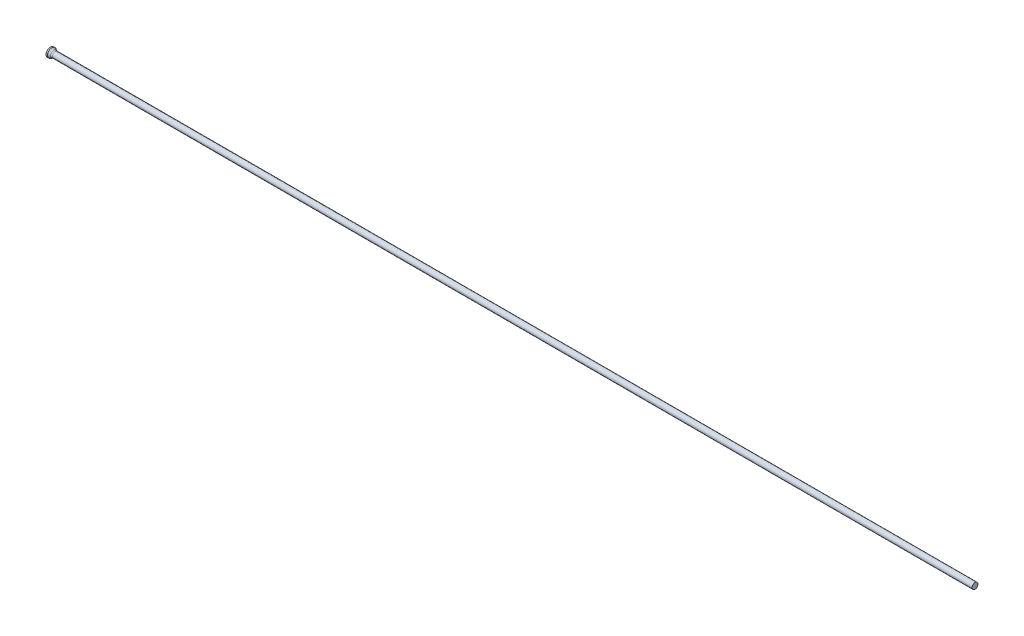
ISO-10303-21;
HEADER;
FILE_DESCRIPTION(('STEP AP214'),'2;1');
FILE_NAME('part.step','',(''),(''),'','','');
FILE_SCHEMA(('AUTOMOTIVE_DESIGN { 1 0 10303 214 1 1 1 1 }'));
ENDSEC;
DATA;
#1=APPLICATION_CONTEXT('core data for automotive mechanical design processes');
#2=APPLICATION_PROTOCOL_DEFINITION('international standard','automotive_design',2000,#1);
#3=PRODUCT_CONTEXT('',#1,'mechanical');
#4=PRODUCT('Part','Part','',(#3));
#5=PRODUCT_RELATED_PRODUCT_CATEGORY('part','',(#4));
#6=PRODUCT_DEFINITION_FORMATION('','',#4);
#7=PRODUCT_DEFINITION_CONTEXT('part definition',#1,'design');
#8=PRODUCT_DEFINITION('design','',#6,#7);
#9=PRODUCT_DEFINITION_SHAPE('','',#8);
#10=(LENGTH_UNIT() NAMED_UNIT(*) SI_UNIT(.MILLI.,.METRE.));
#11=(NAMED_UNIT(*) PLANE_ANGLE_UNIT() SI_UNIT($,.RADIAN.));
#12=(NAMED_UNIT(*) SI_UNIT($,.STERADIAN.) SOLID_ANGLE_UNIT());
#13=UNCERTAINTY_MEASURE_WITH_UNIT(LENGTH_MEASURE(1.E-05),#10,'distance_accuracy_value','');
#14=(GEOMETRIC_REPRESENTATION_CONTEXT(3) GLOBAL_UNCERTAINTY_ASSIGNED_CONTEXT((#13)) GLOBAL_UNIT_ASSIGNED_CONTEXT((#10,
#11,#12)) REPRESENTATION_CONTEXT('',''));
#15=CARTESIAN_POINT('',(0.,0.,0.));
#16=DIRECTION('',(0.,0.,1.));
#17=DIRECTION('',(1.,0.,0.));
#18=AXIS2_PLACEMENT_3D('',#15,#16,#17);
#19=CARTESIAN_POINT('',(0.,0.,0.));
#20=DIRECTION('',(1.,0.,0.));
#21=DIRECTION('',(0.,0.,-1.));
#22=AXIS2_PLACEMENT_3D('',#19,#20,#21);
#23=PLANE('',#22);
#24=CARTESIAN_POINT('',(0.,0.,0.));
#25=DIRECTION('',(-1.,0.,0.));
#26=DIRECTION('',(0.,0.,1.));
#27=AXIS2_PLACEMENT_3D('',#24,#25,#26);
#28=CIRCLE('',#27,1.5);
#29=CARTESIAN_POINT('',(0.,0.,1.5));
#30=VERTEX_POINT('',#29);
#31=EDGE_CURVE('E25',#30,#30,#28,.T.);
#32=ORIENTED_EDGE('',*,*,#31,.T.);
#33=EDGE_LOOP('',(#32));
#34=FACE_BOUND('',#33,.T.);
#35=ADVANCED_FACE('F14',(#34),#23,.F.);
#36=CARTESIAN_POINT('',(0.,0.,0.));
#37=DIRECTION('',(-1.,0.,0.));
#38=DIRECTION('',(0.,0.,1.));
#39=AXIS2_PLACEMENT_3D('',#36,#37,#38);
#40=CYLINDRICAL_SURFACE('',#39,1.5);
#41=ORIENTED_EDGE('',*,*,#31,.F.);
#42=EDGE_LOOP('',(#41));
#43=FACE_BOUND('',#42,.T.);
#44=CARTESIAN_POINT('',(0.503974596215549,0.,0.));
#45=DIRECTION('',(-1.,0.,0.));
#46=DIRECTION('',(0.,0.,1.));
#47=AXIS2_PLACEMENT_3D('',#44,#45,#46);
#48=CIRCLE('',#47,1.5);
#49=CARTESIAN_POINT('',(0.503974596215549,0.,1.5));
#50=VERTEX_POINT('',#49);
#51=EDGE_CURVE('E29',#50,#50,#48,.T.);
#52=ORIENTED_EDGE('',*,*,#51,.T.);
#53=EDGE_LOOP('',(#52));
#54=FACE_BOUND('',#53,.T.);
#55=ADVANCED_FACE('F53',(#43,#54),#40,.T.);
#56=CARTESIAN_POINT('',(1.37,0.,0.));
#57=DIRECTION('',(-1.,0.,0.));
#58=DIRECTION('',(0.,0.,1.));
#59=AXIS2_PLACEMENT_3D('',#56,#57,#58);
#60=CONICAL_SURFACE('',#59,1.,0.523598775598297);
#61=CARTESIAN_POINT('',(1.13794919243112,0.,0.));
#62=DIRECTION('',(-1.,0.,0.));
#63=DIRECTION('',(0.,0.,1.));
#64=AXIS2_PLACEMENT_3D('',#61,#62,#63);
#65=CIRCLE('',#64,1.13397459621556);
#66=CARTESIAN_POINT('',(1.13794919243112,0.,1.13397459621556));
#67=VERTEX_POINT('',#66);
#68=EDGE_CURVE('E21',#67,#67,#65,.T.);
#69=ORIENTED_EDGE('',*,*,#68,.T.);
#70=EDGE_LOOP('',(#69));
#71=FACE_BOUND('',#70,.T.);
#72=ORIENTED_EDGE('',*,*,#51,.F.);
#73=EDGE_LOOP('',(#72));
#74=FACE_BOUND('',#73,.T.);
#75=ADVANCED_FACE('F50',(#71,#74),#60,.T.);
#76=CARTESIAN_POINT('',(0.,0.,0.));
#77=DIRECTION('',(-1.,0.,0.));
#78=DIRECTION('',(0.,0.,1.));
#79=AXIS2_PLACEMENT_3D('',#76,#77,#78);
#80=CYLINDRICAL_SURFACE('',#79,1.);
#81=CARTESIAN_POINT('',(1.63794919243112,0.,0.));
#82=DIRECTION('',(-1.,0.,0.));
#83=DIRECTION('',(0.,0.,1.));
#84=AXIS2_PLACEMENT_3D('',#81,#82,#83);
#85=CIRCLE('',#84,1.);
#86=CARTESIAN_POINT('',(1.63794919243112,0.,1.));
#87=VERTEX_POINT('',#86);
#88=EDGE_CURVE('E9',#87,#87,#85,.F.);
#89=ORIENTED_EDGE('',*,*,#88,.T.);
#90=EDGE_LOOP('',(#89));
#91=FACE_BOUND('',#90,.T.);
#92=CARTESIAN_POINT('',(315.,0.,0.));
#93=DIRECTION('',(-1.,0.,0.));
#94=DIRECTION('',(0.,0.,1.));
#95=AXIS2_PLACEMENT_3D('',#92,#93,#94);
#96=CIRCLE('',#95,1.);
#97=CARTESIAN_POINT('',(315.,0.,1.));
#98=VERTEX_POINT('',#97);
#99=EDGE_CURVE('E34',#98,#98,#96,.T.);
#100=ORIENTED_EDGE('',*,*,#99,.T.);
#101=EDGE_LOOP('',(#100));
#102=FACE_BOUND('',#101,.T.);
#103=ADVANCED_FACE('F38',(#91,#102),#80,.T.);
#104=CARTESIAN_POINT('',(315.,1.,0.));
#105=DIRECTION('',(-1.,0.,0.));
#106=DIRECTION('',(0.,0.,1.));
#107=AXIS2_PLACEMENT_3D('',#104,#105,#106);
#108=PLANE('',#107);
#109=ORIENTED_EDGE('',*,*,#99,.F.);
#110=EDGE_LOOP('',(#109));
#111=FACE_BOUND('',#110,.T.);
#112=ADVANCED_FACE('F40',(#111),#108,.F.);
#113=CARTESIAN_POINT('',(1.63794919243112,0.,0.));
#114=DIRECTION('',(-1.,0.,0.));
#115=DIRECTION('',(0.,0.,1.));
#116=AXIS2_PLACEMENT_3D('',#113,#114,#115);
#117=TOROIDAL_SURFACE('',#116,2.,1.);
#118=ORIENTED_EDGE('',*,*,#88,.F.);
#119=EDGE_LOOP('',(#118));
#120=FACE_BOUND('',#119,.T.);
#121=ORIENTED_EDGE('',*,*,#68,.F.);
#122=EDGE_LOOP('',(#121));
#123=FACE_BOUND('',#122,.T.);
#124=ADVANCED_FACE('F16',(#120,#123),#117,.F.);
#125=CLOSED_SHELL('',(#35,#55,#75,#103,#112,#124));
#126=MANIFOLD_SOLID_BREP('B1',#125);
#127=ADVANCED_BREP_SHAPE_REPRESENTATION('',(#18,#126),#14);
#128=SHAPE_DEFINITION_REPRESENTATION(#9,#127);
ENDSEC;
END-ISO-10303-21;
